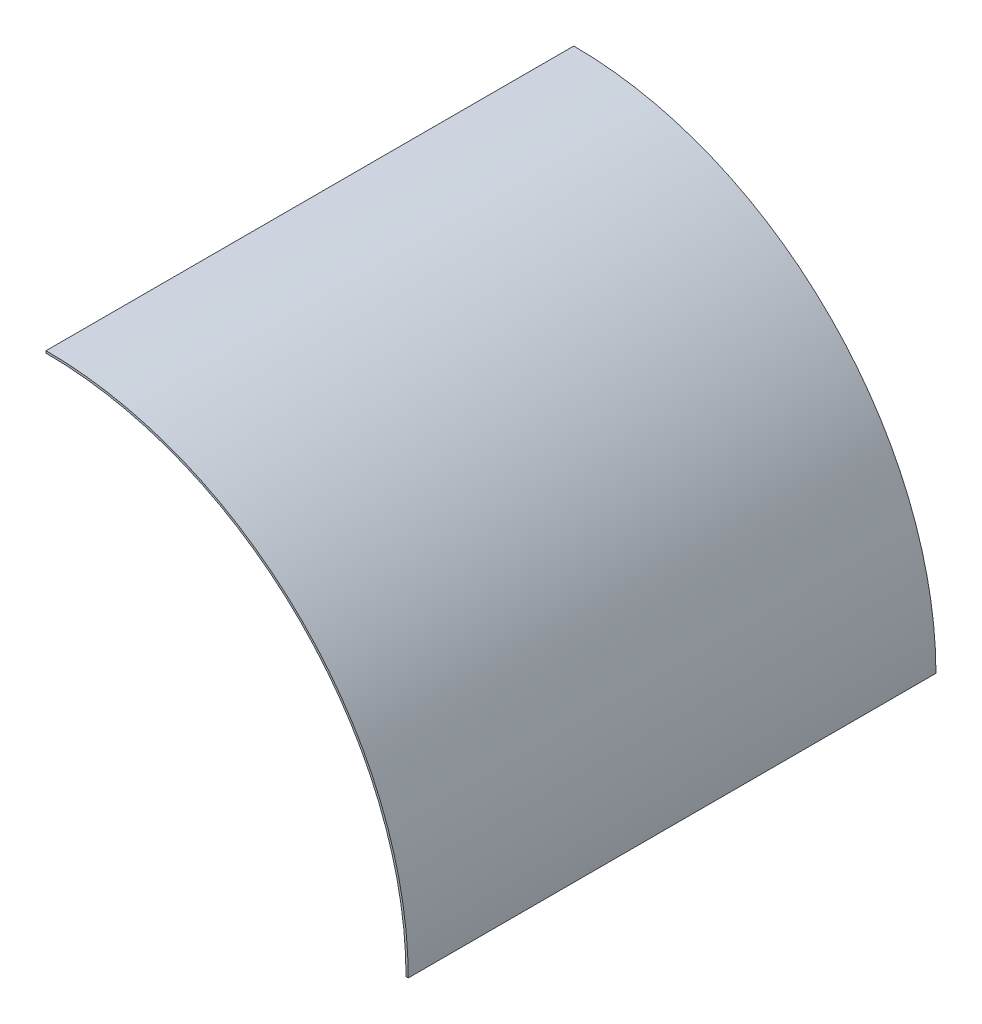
ISO-10303-21;
HEADER;
FILE_DESCRIPTION(('STEP AP214'),'2;1');
FILE_NAME('part.step','',(''),(''),'','','');
FILE_SCHEMA(('AUTOMOTIVE_DESIGN { 1 0 10303 214 1 1 1 1 }'));
ENDSEC;
DATA;
#1=APPLICATION_CONTEXT('core data for automotive mechanical design processes');
#2=APPLICATION_PROTOCOL_DEFINITION('international standard','automotive_design',2000,#1);
#3=PRODUCT_CONTEXT('',#1,'mechanical');
#4=PRODUCT('Part','Part','',(#3));
#5=PRODUCT_RELATED_PRODUCT_CATEGORY('part','',(#4));
#6=PRODUCT_DEFINITION_FORMATION('','',#4);
#7=PRODUCT_DEFINITION_CONTEXT('part definition',#1,'design');
#8=PRODUCT_DEFINITION('design','',#6,#7);
#9=PRODUCT_DEFINITION_SHAPE('','',#8);
#10=(LENGTH_UNIT() NAMED_UNIT(*) SI_UNIT(.MILLI.,.METRE.));
#11=(NAMED_UNIT(*) PLANE_ANGLE_UNIT() SI_UNIT($,.RADIAN.));
#12=(NAMED_UNIT(*) SI_UNIT($,.STERADIAN.) SOLID_ANGLE_UNIT());
#13=UNCERTAINTY_MEASURE_WITH_UNIT(LENGTH_MEASURE(1.E-05),#10,'distance_accuracy_value','');
#14=(GEOMETRIC_REPRESENTATION_CONTEXT(3) GLOBAL_UNCERTAINTY_ASSIGNED_CONTEXT((#13)) GLOBAL_UNIT_ASSIGNED_CONTEXT((#10,
#11,#12)) REPRESENTATION_CONTEXT('',''));
#15=CARTESIAN_POINT('',(0.,0.,0.));
#16=DIRECTION('',(0.,0.,1.));
#17=DIRECTION('',(1.,0.,0.));
#18=AXIS2_PLACEMENT_3D('',#15,#16,#17);
#19=CARTESIAN_POINT('',(0.,0.,-3000.));
#20=DIRECTION('',(0.,0.,1.));
#21=DIRECTION('',(1.,0.,0.));
#22=AXIS2_PLACEMENT_3D('',#19,#20,#21);
#23=CYLINDRICAL_SURFACE('',#22,2046.5);
#24=CARTESIAN_POINT('',(0.,0.,0.));
#25=DIRECTION('',(0.,0.,-1.));
#26=DIRECTION('',(-1.,0.,0.));
#27=AXIS2_PLACEMENT_3D('',#24,#25,#26);
#28=CIRCLE('',#27,2046.5);
#29=CARTESIAN_POINT('',(0.,2046.5,0.));
#30=VERTEX_POINT('',#29);
#31=CARTESIAN_POINT('',(2046.5,0.,0.));
#32=VERTEX_POINT('',#31);
#33=EDGE_CURVE('E100',#30,#32,#28,.T.);
#34=ORIENTED_EDGE('',*,*,#33,.F.);
#35=DIRECTION('',(0.,0.,1.));
#36=VECTOR('',#35,1.);
#37=CARTESIAN_POINT('',(0.,2046.5,-3000.));
#38=LINE('',#37,#36);
#39=CARTESIAN_POINT('',(0.,2046.5,-3000.));
#40=VERTEX_POINT('',#39);
#41=EDGE_CURVE('E11',#40,#30,#38,.T.);
#42=ORIENTED_EDGE('',*,*,#41,.F.);
#43=CARTESIAN_POINT('',(0.,0.,-3000.));
#44=DIRECTION('',(0.,0.,-1.));
#45=DIRECTION('',(-1.,0.,0.));
#46=AXIS2_PLACEMENT_3D('',#43,#44,#45);
#47=CIRCLE('',#46,2046.5);
#48=CARTESIAN_POINT('',(2046.5,0.,-3000.));
#49=VERTEX_POINT('',#48);
#50=EDGE_CURVE('E94',#40,#49,#47,.T.);
#51=ORIENTED_EDGE('',*,*,#50,.T.);
#52=DIRECTION('',(0.,0.,1.));
#53=VECTOR('',#52,1.);
#54=CARTESIAN_POINT('',(2046.5,0.,-3000.));
#55=LINE('',#54,#53);
#56=EDGE_CURVE('E39',#49,#32,#55,.T.);
#57=ORIENTED_EDGE('',*,*,#56,.T.);
#58=EDGE_LOOP('',(#34,#42,#51,#57));
#59=FACE_BOUND('',#58,.T.);
#60=ADVANCED_FACE('F36',(#59),#23,.F.);
#61=CARTESIAN_POINT('',(0.,2059.,-3000.));
#62=DIRECTION('',(-1.,0.,0.));
#63=DIRECTION('',(0.,0.,1.));
#64=AXIS2_PLACEMENT_3D('',#61,#62,#63);
#65=PLANE('',#64);
#66=DIRECTION('',(0.,-1.,0.));
#67=VECTOR('',#66,1.);
#68=CARTESIAN_POINT('',(0.,2059.,0.));
#69=LINE('',#68,#67);
#70=CARTESIAN_POINT('',(0.,2059.,0.));
#71=VERTEX_POINT('',#70);
#72=EDGE_CURVE('E96',#71,#30,#69,.T.);
#73=ORIENTED_EDGE('',*,*,#72,.F.);
#74=DIRECTION('',(0.,0.,1.));
#75=VECTOR('',#74,1.);
#76=CARTESIAN_POINT('',(0.,2059.,-3000.));
#77=LINE('',#76,#75);
#78=CARTESIAN_POINT('',(0.,2059.,-3000.));
#79=VERTEX_POINT('',#78);
#80=EDGE_CURVE('E45',#79,#71,#77,.T.);
#81=ORIENTED_EDGE('',*,*,#80,.F.);
#82=DIRECTION('',(0.,-1.,0.));
#83=VECTOR('',#82,1.);
#84=CARTESIAN_POINT('',(0.,2059.,-3000.));
#85=LINE('',#84,#83);
#86=EDGE_CURVE('E91',#79,#40,#85,.T.);
#87=ORIENTED_EDGE('',*,*,#86,.T.);
#88=ORIENTED_EDGE('',*,*,#41,.T.);
#89=EDGE_LOOP('',(#73,#81,#87,#88));
#90=FACE_BOUND('',#89,.T.);
#91=ADVANCED_FACE('F110',(#90),#65,.T.);
#92=CARTESIAN_POINT('',(0.,0.,-3000.));
#93=DIRECTION('',(0.,0.,1.));
#94=DIRECTION('',(1.,0.,0.));
#95=AXIS2_PLACEMENT_3D('',#92,#93,#94);
#96=CYLINDRICAL_SURFACE('',#95,2059.);
#97=CARTESIAN_POINT('',(0.,0.,0.));
#98=DIRECTION('',(0.,0.,1.));
#99=DIRECTION('',(-1.,0.,0.));
#100=AXIS2_PLACEMENT_3D('',#97,#98,#99);
#101=CIRCLE('',#100,2059.);
#102=CARTESIAN_POINT('',(2059.,2.5215477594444E-13,0.));
#103=VERTEX_POINT('',#102);
#104=EDGE_CURVE('E86',#103,#71,#101,.T.);
#105=ORIENTED_EDGE('',*,*,#104,.F.);
#106=DIRECTION('',(0.,0.,1.));
#107=VECTOR('',#106,1.);
#108=CARTESIAN_POINT('',(2059.,2.5215477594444E-13,-3000.));
#109=LINE('',#108,#107);
#110=CARTESIAN_POINT('',(2059.,2.5215477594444E-13,-3000.));
#111=VERTEX_POINT('',#110);
#112=EDGE_CURVE('E81',#111,#103,#109,.T.);
#113=ORIENTED_EDGE('',*,*,#112,.F.);
#114=CARTESIAN_POINT('',(0.,0.,-3000.));
#115=DIRECTION('',(0.,0.,1.));
#116=DIRECTION('',(-1.,0.,0.));
#117=AXIS2_PLACEMENT_3D('',#114,#115,#116);
#118=CIRCLE('',#117,2059.);
#119=EDGE_CURVE('E84',#111,#79,#118,.T.);
#120=ORIENTED_EDGE('',*,*,#119,.T.);
#121=ORIENTED_EDGE('',*,*,#80,.T.);
#122=EDGE_LOOP('',(#105,#113,#120,#121));
#123=FACE_BOUND('',#122,.T.);
#124=ADVANCED_FACE('F83',(#123),#96,.T.);
#125=CARTESIAN_POINT('',(2059.,0.,-3000.));
#126=DIRECTION('',(0.,-1.,0.));
#127=DIRECTION('',(0.,0.,-1.));
#128=AXIS2_PLACEMENT_3D('',#125,#126,#127);
#129=PLANE('',#128);
#130=DIRECTION('',(1.,0.,0.));
#131=VECTOR('',#130,1.);
#132=CARTESIAN_POINT('',(2059.,0.,0.));
#133=LINE('',#132,#131);
#134=EDGE_CURVE('E103',#32,#103,#133,.T.);
#135=ORIENTED_EDGE('',*,*,#134,.F.);
#136=ORIENTED_EDGE('',*,*,#56,.F.);
#137=DIRECTION('',(1.,0.,0.));
#138=VECTOR('',#137,1.);
#139=CARTESIAN_POINT('',(2059.,0.,-3000.));
#140=LINE('',#139,#138);
#141=EDGE_CURVE('E90',#49,#111,#140,.T.);
#142=ORIENTED_EDGE('',*,*,#141,.T.);
#143=ORIENTED_EDGE('',*,*,#112,.T.);
#144=EDGE_LOOP('',(#135,#136,#142,#143));
#145=FACE_BOUND('',#144,.T.);
#146=ADVANCED_FACE('F93',(#145),#129,.T.);
#147=CARTESIAN_POINT('',(0.,0.,-3000.));
#148=DIRECTION('',(0.,0.,-1.));
#149=DIRECTION('',(-1.,0.,0.));
#150=AXIS2_PLACEMENT_3D('',#147,#148,#149);
#151=PLANE('',#150);
#152=ORIENTED_EDGE('',*,*,#50,.F.);
#153=ORIENTED_EDGE('',*,*,#86,.F.);
#154=ORIENTED_EDGE('',*,*,#119,.F.);
#155=ORIENTED_EDGE('',*,*,#141,.F.);
#156=EDGE_LOOP('',(#152,#153,#154,#155));
#157=FACE_BOUND('',#156,.T.);
#158=ADVANCED_FACE('F89',(#157),#151,.T.);
#159=CARTESIAN_POINT('',(0.,0.,0.));
#160=DIRECTION('',(0.,0.,-1.));
#161=DIRECTION('',(-1.,0.,0.));
#162=AXIS2_PLACEMENT_3D('',#159,#160,#161);
#163=PLANE('',#162);
#164=ORIENTED_EDGE('',*,*,#33,.T.);
#165=ORIENTED_EDGE('',*,*,#134,.T.);
#166=ORIENTED_EDGE('',*,*,#104,.T.);
#167=ORIENTED_EDGE('',*,*,#72,.T.);
#168=EDGE_LOOP('',(#164,#165,#166,#167));
#169=FACE_BOUND('',#168,.T.);
#170=ADVANCED_FACE('F109',(#169),#163,.F.);
#171=CLOSED_SHELL('',(#60,#91,#124,#146,#158,#170));
#172=MANIFOLD_SOLID_BREP('B2',#171);
#173=ADVANCED_BREP_SHAPE_REPRESENTATION('',(#18,#172),#14);
#174=SHAPE_DEFINITION_REPRESENTATION(#9,#173);
ENDSEC;
END-ISO-10303-21;
